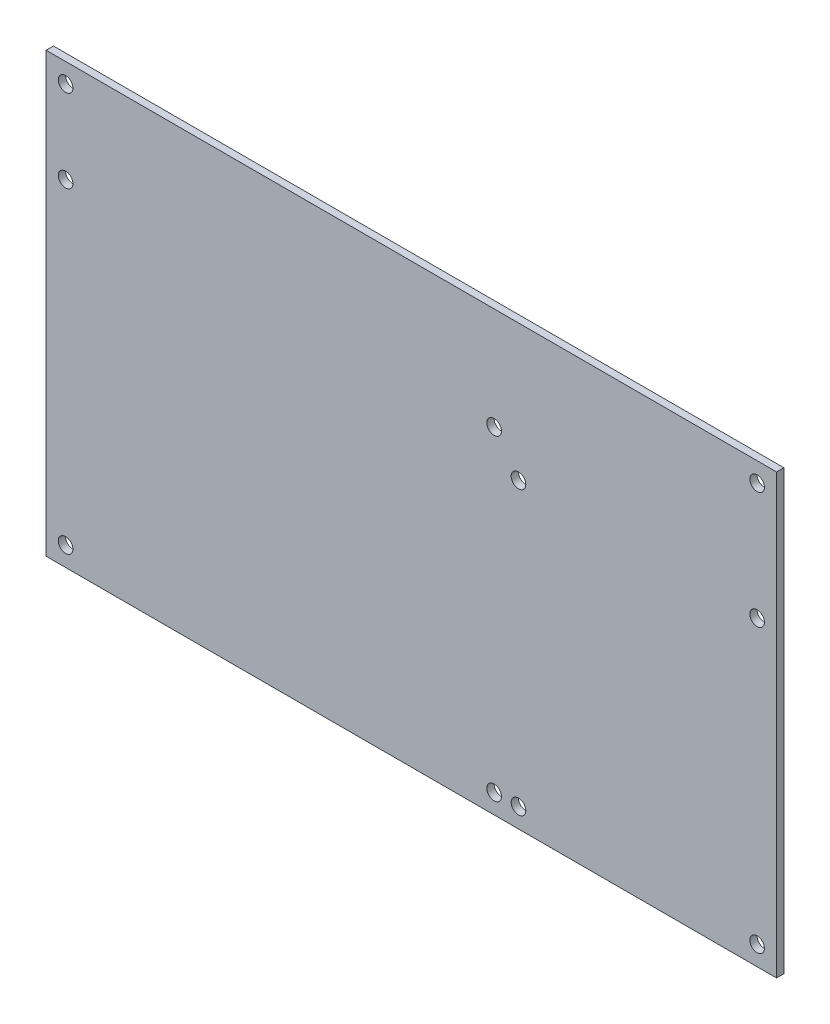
ISO-10303-21;
HEADER;
FILE_DESCRIPTION(('STEP AP214'),'2;1');
FILE_NAME('part.step','',(''),(''),'','','');
FILE_SCHEMA(('AUTOMOTIVE_DESIGN { 1 0 10303 214 1 1 1 1 }'));
ENDSEC;
DATA;
#1=APPLICATION_CONTEXT('core data for automotive mechanical design processes');
#2=APPLICATION_PROTOCOL_DEFINITION('international standard','automotive_design',2000,#1);
#3=PRODUCT_CONTEXT('',#1,'mechanical');
#4=PRODUCT('Part','Part','',(#3));
#5=PRODUCT_RELATED_PRODUCT_CATEGORY('part','',(#4));
#6=PRODUCT_DEFINITION_FORMATION('','',#4);
#7=PRODUCT_DEFINITION_CONTEXT('part definition',#1,'design');
#8=PRODUCT_DEFINITION('design','',#6,#7);
#9=PRODUCT_DEFINITION_SHAPE('','',#8);
#10=(LENGTH_UNIT() NAMED_UNIT(*) SI_UNIT(.MILLI.,.METRE.));
#11=(NAMED_UNIT(*) PLANE_ANGLE_UNIT() SI_UNIT($,.RADIAN.));
#12=(NAMED_UNIT(*) SI_UNIT($,.STERADIAN.) SOLID_ANGLE_UNIT());
#13=UNCERTAINTY_MEASURE_WITH_UNIT(LENGTH_MEASURE(1.E-05),#10,'distance_accuracy_value','');
#14=(GEOMETRIC_REPRESENTATION_CONTEXT(3) GLOBAL_UNCERTAINTY_ASSIGNED_CONTEXT((#13)) GLOBAL_UNIT_ASSIGNED_CONTEXT((#10,
#11,#12)) REPRESENTATION_CONTEXT('',''));
#15=CARTESIAN_POINT('',(0.,0.,0.));
#16=DIRECTION('',(0.,0.,1.));
#17=DIRECTION('',(1.,0.,0.));
#18=AXIS2_PLACEMENT_3D('',#15,#16,#17);
#19=CARTESIAN_POINT('',(0.,0.,1.5));
#20=DIRECTION('',(0.,0.,1.));
#21=DIRECTION('',(1.,0.,0.));
#22=AXIS2_PLACEMENT_3D('',#19,#20,#21);
#23=PLANE('',#22);
#24=CARTESIAN_POINT('',(97.,-86.,1.5));
#25=DIRECTION('',(0.,0.,1.));
#26=DIRECTION('',(1.,0.,0.));
#27=AXIS2_PLACEMENT_3D('',#24,#25,#26);
#28=CIRCLE('',#27,1.5);
#29=CARTESIAN_POINT('',(98.5,-86.,1.5));
#30=VERTEX_POINT('',#29);
#31=EDGE_CURVE('E203',#30,#30,#28,.T.);
#32=ORIENTED_EDGE('',*,*,#31,.F.);
#33=EDGE_LOOP('',(#32));
#34=FACE_BOUND('',#33,.T.);
#35=CARTESIAN_POINT('',(92.,-86.,1.5));
#36=DIRECTION('',(0.,0.,1.));
#37=DIRECTION('',(1.,0.,0.));
#38=AXIS2_PLACEMENT_3D('',#35,#36,#37);
#39=CIRCLE('',#38,1.5);
#40=CARTESIAN_POINT('',(93.5,-86.,1.5));
#41=VERTEX_POINT('',#40);
#42=EDGE_CURVE('E187',#41,#41,#39,.T.);
#43=ORIENTED_EDGE('',*,*,#42,.F.);
#44=EDGE_LOOP('',(#43));
#45=FACE_BOUND('',#44,.T.);
#46=CARTESIAN_POINT('',(97.,-28.,1.5));
#47=DIRECTION('',(0.,0.,1.));
#48=DIRECTION('',(1.,0.,0.));
#49=AXIS2_PLACEMENT_3D('',#46,#47,#48);
#50=CIRCLE('',#49,1.5);
#51=CARTESIAN_POINT('',(98.5,-28.,1.5));
#52=VERTEX_POINT('',#51);
#53=EDGE_CURVE('E171',#52,#52,#50,.T.);
#54=ORIENTED_EDGE('',*,*,#53,.F.);
#55=EDGE_LOOP('',(#54));
#56=FACE_BOUND('',#55,.T.);
#57=CARTESIAN_POINT('',(4.00000000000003,-86.,1.5));
#58=DIRECTION('',(0.,0.,1.));
#59=DIRECTION('',(-1.,0.,0.));
#60=AXIS2_PLACEMENT_3D('',#57,#58,#59);
#61=CIRCLE('',#60,1.5);
#62=CARTESIAN_POINT('',(2.50000000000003,-86.,1.5));
#63=VERTEX_POINT('',#62);
#64=EDGE_CURVE('E155',#63,#63,#61,.T.);
#65=ORIENTED_EDGE('',*,*,#64,.F.);
#66=EDGE_LOOP('',(#65));
#67=FACE_BOUND('',#66,.T.);
#68=CARTESIAN_POINT('',(146.,-4.,1.5));
#69=DIRECTION('',(0.,0.,1.));
#70=DIRECTION('',(1.,0.,0.));
#71=AXIS2_PLACEMENT_3D('',#68,#69,#70);
#72=CIRCLE('',#71,1.5);
#73=CARTESIAN_POINT('',(147.5,-4.,1.5));
#74=VERTEX_POINT('',#73);
#75=EDGE_CURVE('E123',#74,#74,#72,.T.);
#76=ORIENTED_EDGE('',*,*,#75,.F.);
#77=EDGE_LOOP('',(#76));
#78=FACE_BOUND('',#77,.T.);
#79=DIRECTION('',(0.,-1.,0.));
#80=VECTOR('',#79,1.);
#81=CARTESIAN_POINT('',(0.,0.,1.5));
#82=LINE('',#81,#80);
#83=CARTESIAN_POINT('',(0.,0.,1.5));
#84=VERTEX_POINT('',#83);
#85=CARTESIAN_POINT('',(0.,-90.,1.5));
#86=VERTEX_POINT('',#85);
#87=EDGE_CURVE('E102',#84,#86,#82,.T.);
#88=ORIENTED_EDGE('',*,*,#87,.T.);
#89=DIRECTION('',(1.,0.,0.));
#90=VECTOR('',#89,1.);
#91=CARTESIAN_POINT('',(0.,-90.,1.5));
#92=LINE('',#91,#90);
#93=CARTESIAN_POINT('',(150.,-90.,1.5));
#94=VERTEX_POINT('',#93);
#95=EDGE_CURVE('E97',#86,#94,#92,.T.);
#96=ORIENTED_EDGE('',*,*,#95,.T.);
#97=DIRECTION('',(0.,1.,0.));
#98=VECTOR('',#97,1.);
#99=CARTESIAN_POINT('',(150.,0.,1.5));
#100=LINE('',#99,#98);
#101=CARTESIAN_POINT('',(150.,0.,1.5));
#102=VERTEX_POINT('',#101);
#103=EDGE_CURVE('E100',#94,#102,#100,.T.);
#104=ORIENTED_EDGE('',*,*,#103,.T.);
#105=DIRECTION('',(-1.,0.,0.));
#106=VECTOR('',#105,1.);
#107=CARTESIAN_POINT('',(0.,0.,1.5));
#108=LINE('',#107,#106);
#109=EDGE_CURVE('E67',#102,#84,#108,.T.);
#110=ORIENTED_EDGE('',*,*,#109,.T.);
#111=EDGE_LOOP('',(#88,#96,#104,#110));
#112=FACE_BOUND('',#111,.T.);
#113=CARTESIAN_POINT('',(146.,-86.,1.5));
#114=DIRECTION('',(0.,0.,1.));
#115=DIRECTION('',(1.,0.,0.));
#116=AXIS2_PLACEMENT_3D('',#113,#114,#115);
#117=CIRCLE('',#116,1.5);
#118=CARTESIAN_POINT('',(147.5,-86.,1.5));
#119=VERTEX_POINT('',#118);
#120=EDGE_CURVE('E147',#119,#119,#117,.T.);
#121=ORIENTED_EDGE('',*,*,#120,.F.);
#122=EDGE_LOOP('',(#121));
#123=FACE_BOUND('',#122,.T.);
#124=CARTESIAN_POINT('',(4.,-4.00000000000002,1.5));
#125=DIRECTION('',(0.,0.,1.));
#126=DIRECTION('',(-1.,0.,0.));
#127=AXIS2_PLACEMENT_3D('',#124,#125,#126);
#128=CIRCLE('',#127,1.5);
#129=CARTESIAN_POINT('',(2.50000000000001,-4.00000000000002,1.5));
#130=VERTEX_POINT('',#129);
#131=EDGE_CURVE('E163',#130,#130,#128,.T.);
#132=ORIENTED_EDGE('',*,*,#131,.F.);
#133=EDGE_LOOP('',(#132));
#134=FACE_BOUND('',#133,.T.);
#135=CARTESIAN_POINT('',(4.00000000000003,-21.,1.5));
#136=DIRECTION('',(0.,0.,1.));
#137=DIRECTION('',(1.,0.,0.));
#138=AXIS2_PLACEMENT_3D('',#135,#136,#137);
#139=CIRCLE('',#138,1.5);
#140=CARTESIAN_POINT('',(5.50000000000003,-21.,1.5));
#141=VERTEX_POINT('',#140);
#142=EDGE_CURVE('E179',#141,#141,#139,.T.);
#143=ORIENTED_EDGE('',*,*,#142,.F.);
#144=EDGE_LOOP('',(#143));
#145=FACE_BOUND('',#144,.T.);
#146=CARTESIAN_POINT('',(92.,-20.9999999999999,1.5));
#147=DIRECTION('',(0.,0.,1.));
#148=DIRECTION('',(1.,0.,0.));
#149=AXIS2_PLACEMENT_3D('',#146,#147,#148);
#150=CIRCLE('',#149,1.5);
#151=CARTESIAN_POINT('',(93.5,-20.9999999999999,1.5));
#152=VERTEX_POINT('',#151);
#153=EDGE_CURVE('E195',#152,#152,#150,.T.);
#154=ORIENTED_EDGE('',*,*,#153,.F.);
#155=EDGE_LOOP('',(#154));
#156=FACE_BOUND('',#155,.T.);
#157=CARTESIAN_POINT('',(146.,-28.,1.5));
#158=DIRECTION('',(0.,0.,1.));
#159=DIRECTION('',(1.,0.,0.));
#160=AXIS2_PLACEMENT_3D('',#157,#158,#159);
#161=CIRCLE('',#160,1.5);
#162=CARTESIAN_POINT('',(147.5,-28.,1.5));
#163=VERTEX_POINT('',#162);
#164=EDGE_CURVE('E211',#163,#163,#161,.T.);
#165=ORIENTED_EDGE('',*,*,#164,.F.);
#166=EDGE_LOOP('',(#165));
#167=FACE_BOUND('',#166,.T.);
#168=ADVANCED_FACE('F49',(#34,#45,#56,#67,#78,#112,#123,#134,#145,#156,#167),#23,.T.);
#169=CARTESIAN_POINT('',(0.,0.,0.));
#170=DIRECTION('',(0.,0.,1.));
#171=DIRECTION('',(1.,0.,0.));
#172=AXIS2_PLACEMENT_3D('',#169,#170,#171);
#173=PLANE('',#172);
#174=DIRECTION('',(0.,-1.,0.));
#175=VECTOR('',#174,1.);
#176=CARTESIAN_POINT('',(0.,0.,0.));
#177=LINE('',#176,#175);
#178=CARTESIAN_POINT('',(0.,0.,0.));
#179=VERTEX_POINT('',#178);
#180=CARTESIAN_POINT('',(0.,-90.,0.));
#181=VERTEX_POINT('',#180);
#182=EDGE_CURVE('E119',#179,#181,#177,.T.);
#183=ORIENTED_EDGE('',*,*,#182,.F.);
#184=DIRECTION('',(-1.,0.,0.));
#185=VECTOR('',#184,1.);
#186=CARTESIAN_POINT('',(0.,0.,0.));
#187=LINE('',#186,#185);
#188=CARTESIAN_POINT('',(150.,0.,0.));
#189=VERTEX_POINT('',#188);
#190=EDGE_CURVE('E90',#189,#179,#187,.T.);
#191=ORIENTED_EDGE('',*,*,#190,.F.);
#192=DIRECTION('',(0.,1.,0.));
#193=VECTOR('',#192,1.);
#194=CARTESIAN_POINT('',(150.,0.,0.));
#195=LINE('',#194,#193);
#196=CARTESIAN_POINT('',(150.,-90.,0.));
#197=VERTEX_POINT('',#196);
#198=EDGE_CURVE('E84',#197,#189,#195,.T.);
#199=ORIENTED_EDGE('',*,*,#198,.F.);
#200=DIRECTION('',(1.,0.,0.));
#201=VECTOR('',#200,1.);
#202=CARTESIAN_POINT('',(0.,-90.,0.));
#203=LINE('',#202,#201);
#204=EDGE_CURVE('E107',#181,#197,#203,.T.);
#205=ORIENTED_EDGE('',*,*,#204,.F.);
#206=EDGE_LOOP('',(#183,#191,#199,#205));
#207=FACE_BOUND('',#206,.T.);
#208=CARTESIAN_POINT('',(146.,-4.,0.));
#209=DIRECTION('',(0.,0.,1.));
#210=DIRECTION('',(1.,0.,0.));
#211=AXIS2_PLACEMENT_3D('',#208,#209,#210);
#212=CIRCLE('',#211,1.5);
#213=CARTESIAN_POINT('',(147.5,-4.,0.));
#214=VERTEX_POINT('',#213);
#215=EDGE_CURVE('E143',#214,#214,#212,.T.);
#216=ORIENTED_EDGE('',*,*,#215,.T.);
#217=EDGE_LOOP('',(#216));
#218=FACE_BOUND('',#217,.T.);
#219=CARTESIAN_POINT('',(146.,-86.,0.));
#220=DIRECTION('',(0.,0.,1.));
#221=DIRECTION('',(1.,0.,0.));
#222=AXIS2_PLACEMENT_3D('',#219,#220,#221);
#223=CIRCLE('',#222,1.5);
#224=CARTESIAN_POINT('',(147.5,-86.,0.));
#225=VERTEX_POINT('',#224);
#226=EDGE_CURVE('E151',#225,#225,#223,.T.);
#227=ORIENTED_EDGE('',*,*,#226,.T.);
#228=EDGE_LOOP('',(#227));
#229=FACE_BOUND('',#228,.T.);
#230=CARTESIAN_POINT('',(4.00000000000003,-86.,0.));
#231=DIRECTION('',(0.,0.,1.));
#232=DIRECTION('',(-1.,0.,0.));
#233=AXIS2_PLACEMENT_3D('',#230,#231,#232);
#234=CIRCLE('',#233,1.5);
#235=CARTESIAN_POINT('',(2.50000000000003,-86.,0.));
#236=VERTEX_POINT('',#235);
#237=EDGE_CURVE('E159',#236,#236,#234,.T.);
#238=ORIENTED_EDGE('',*,*,#237,.T.);
#239=EDGE_LOOP('',(#238));
#240=FACE_BOUND('',#239,.T.);
#241=CARTESIAN_POINT('',(4.,-4.00000000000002,0.));
#242=DIRECTION('',(0.,0.,1.));
#243=DIRECTION('',(-1.,0.,0.));
#244=AXIS2_PLACEMENT_3D('',#241,#242,#243);
#245=CIRCLE('',#244,1.5);
#246=CARTESIAN_POINT('',(2.50000000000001,-4.00000000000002,0.));
#247=VERTEX_POINT('',#246);
#248=EDGE_CURVE('E167',#247,#247,#245,.T.);
#249=ORIENTED_EDGE('',*,*,#248,.T.);
#250=EDGE_LOOP('',(#249));
#251=FACE_BOUND('',#250,.T.);
#252=CARTESIAN_POINT('',(97.,-28.,0.));
#253=DIRECTION('',(0.,0.,1.));
#254=DIRECTION('',(1.,0.,0.));
#255=AXIS2_PLACEMENT_3D('',#252,#253,#254);
#256=CIRCLE('',#255,1.5);
#257=CARTESIAN_POINT('',(98.5,-28.,0.));
#258=VERTEX_POINT('',#257);
#259=EDGE_CURVE('E175',#258,#258,#256,.T.);
#260=ORIENTED_EDGE('',*,*,#259,.T.);
#261=EDGE_LOOP('',(#260));
#262=FACE_BOUND('',#261,.T.);
#263=CARTESIAN_POINT('',(4.00000000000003,-21.,0.));
#264=DIRECTION('',(0.,0.,1.));
#265=DIRECTION('',(1.,0.,0.));
#266=AXIS2_PLACEMENT_3D('',#263,#264,#265);
#267=CIRCLE('',#266,1.5);
#268=CARTESIAN_POINT('',(5.50000000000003,-21.,0.));
#269=VERTEX_POINT('',#268);
#270=EDGE_CURVE('E183',#269,#269,#267,.T.);
#271=ORIENTED_EDGE('',*,*,#270,.T.);
#272=EDGE_LOOP('',(#271));
#273=FACE_BOUND('',#272,.T.);
#274=CARTESIAN_POINT('',(92.,-86.,0.));
#275=DIRECTION('',(0.,0.,1.));
#276=DIRECTION('',(1.,0.,0.));
#277=AXIS2_PLACEMENT_3D('',#274,#275,#276);
#278=CIRCLE('',#277,1.5);
#279=CARTESIAN_POINT('',(93.5,-86.,0.));
#280=VERTEX_POINT('',#279);
#281=EDGE_CURVE('E191',#280,#280,#278,.T.);
#282=ORIENTED_EDGE('',*,*,#281,.T.);
#283=EDGE_LOOP('',(#282));
#284=FACE_BOUND('',#283,.T.);
#285=CARTESIAN_POINT('',(92.,-20.9999999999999,0.));
#286=DIRECTION('',(0.,0.,1.));
#287=DIRECTION('',(1.,0.,0.));
#288=AXIS2_PLACEMENT_3D('',#285,#286,#287);
#289=CIRCLE('',#288,1.5);
#290=CARTESIAN_POINT('',(93.5,-20.9999999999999,0.));
#291=VERTEX_POINT('',#290);
#292=EDGE_CURVE('E199',#291,#291,#289,.T.);
#293=ORIENTED_EDGE('',*,*,#292,.T.);
#294=EDGE_LOOP('',(#293));
#295=FACE_BOUND('',#294,.T.);
#296=CARTESIAN_POINT('',(97.,-86.,0.));
#297=DIRECTION('',(0.,0.,1.));
#298=DIRECTION('',(1.,0.,0.));
#299=AXIS2_PLACEMENT_3D('',#296,#297,#298);
#300=CIRCLE('',#299,1.5);
#301=CARTESIAN_POINT('',(98.5,-86.,0.));
#302=VERTEX_POINT('',#301);
#303=EDGE_CURVE('E207',#302,#302,#300,.T.);
#304=ORIENTED_EDGE('',*,*,#303,.T.);
#305=EDGE_LOOP('',(#304));
#306=FACE_BOUND('',#305,.T.);
#307=CARTESIAN_POINT('',(146.,-28.,0.));
#308=DIRECTION('',(0.,0.,1.));
#309=DIRECTION('',(1.,0.,0.));
#310=AXIS2_PLACEMENT_3D('',#307,#308,#309);
#311=CIRCLE('',#310,1.5);
#312=CARTESIAN_POINT('',(147.5,-28.,0.));
#313=VERTEX_POINT('',#312);
#314=EDGE_CURVE('E215',#313,#313,#311,.T.);
#315=ORIENTED_EDGE('',*,*,#314,.T.);
#316=EDGE_LOOP('',(#315));
#317=FACE_BOUND('',#316,.T.);
#318=ADVANCED_FACE('F137',(#207,#218,#229,#240,#251,#262,#273,#284,#295,#306,#317),#173,.F.);
#319=CARTESIAN_POINT('',(0.,0.,1.5));
#320=DIRECTION('',(1.,0.,0.));
#321=DIRECTION('',(0.,1.,0.));
#322=AXIS2_PLACEMENT_3D('',#319,#320,#321);
#323=PLANE('',#322);
#324=ORIENTED_EDGE('',*,*,#182,.T.);
#325=DIRECTION('',(0.,0.,-1.));
#326=VECTOR('',#325,1.);
#327=CARTESIAN_POINT('',(0.,-90.,1.5));
#328=LINE('',#327,#326);
#329=EDGE_CURVE('E11',#86,#181,#328,.T.);
#330=ORIENTED_EDGE('',*,*,#329,.F.);
#331=ORIENTED_EDGE('',*,*,#87,.F.);
#332=DIRECTION('',(0.,0.,-1.));
#333=VECTOR('',#332,1.);
#334=CARTESIAN_POINT('',(0.,0.,1.5));
#335=LINE('',#334,#333);
#336=EDGE_CURVE('E115',#84,#179,#335,.T.);
#337=ORIENTED_EDGE('',*,*,#336,.T.);
#338=EDGE_LOOP('',(#324,#330,#331,#337));
#339=FACE_BOUND('',#338,.T.);
#340=ADVANCED_FACE('F51',(#339),#323,.F.);
#341=CARTESIAN_POINT('',(0.,-90.,1.5));
#342=DIRECTION('',(0.,1.,0.));
#343=DIRECTION('',(0.,0.,1.));
#344=AXIS2_PLACEMENT_3D('',#341,#342,#343);
#345=PLANE('',#344);
#346=ORIENTED_EDGE('',*,*,#204,.T.);
#347=DIRECTION('',(0.,0.,-1.));
#348=VECTOR('',#347,1.);
#349=CARTESIAN_POINT('',(150.,-90.,1.5));
#350=LINE('',#349,#348);
#351=EDGE_CURVE('E59',#94,#197,#350,.T.);
#352=ORIENTED_EDGE('',*,*,#351,.F.);
#353=ORIENTED_EDGE('',*,*,#95,.F.);
#354=ORIENTED_EDGE('',*,*,#329,.T.);
#355=EDGE_LOOP('',(#346,#352,#353,#354));
#356=FACE_BOUND('',#355,.T.);
#357=ADVANCED_FACE('F106',(#356),#345,.F.);
#358=CARTESIAN_POINT('',(150.,0.,1.5));
#359=DIRECTION('',(-1.,0.,0.));
#360=DIRECTION('',(0.,0.,1.));
#361=AXIS2_PLACEMENT_3D('',#358,#359,#360);
#362=PLANE('',#361);
#363=ORIENTED_EDGE('',*,*,#198,.T.);
#364=DIRECTION('',(0.,0.,-1.));
#365=VECTOR('',#364,1.);
#366=CARTESIAN_POINT('',(150.,0.,1.5));
#367=LINE('',#366,#365);
#368=EDGE_CURVE('E109',#102,#189,#367,.T.);
#369=ORIENTED_EDGE('',*,*,#368,.F.);
#370=ORIENTED_EDGE('',*,*,#103,.F.);
#371=ORIENTED_EDGE('',*,*,#351,.T.);
#372=EDGE_LOOP('',(#363,#369,#370,#371));
#373=FACE_BOUND('',#372,.T.);
#374=ADVANCED_FACE('F110',(#373),#362,.F.);
#375=CARTESIAN_POINT('',(0.,0.,1.5));
#376=DIRECTION('',(0.,-1.,0.));
#377=DIRECTION('',(0.,0.,-1.));
#378=AXIS2_PLACEMENT_3D('',#375,#376,#377);
#379=PLANE('',#378);
#380=ORIENTED_EDGE('',*,*,#190,.T.);
#381=ORIENTED_EDGE('',*,*,#336,.F.);
#382=ORIENTED_EDGE('',*,*,#109,.F.);
#383=ORIENTED_EDGE('',*,*,#368,.T.);
#384=EDGE_LOOP('',(#380,#381,#382,#383));
#385=FACE_BOUND('',#384,.T.);
#386=ADVANCED_FACE('F134',(#385),#379,.F.);
#387=CARTESIAN_POINT('',(146.,-4.,1.5));
#388=DIRECTION('',(0.,0.,-1.));
#389=DIRECTION('',(-1.,0.,0.));
#390=AXIS2_PLACEMENT_3D('',#387,#388,#389);
#391=CYLINDRICAL_SURFACE('',#390,1.5);
#392=ORIENTED_EDGE('',*,*,#75,.T.);
#393=EDGE_LOOP('',(#392));
#394=FACE_BOUND('',#393,.T.);
#395=ORIENTED_EDGE('',*,*,#215,.F.);
#396=EDGE_LOOP('',(#395));
#397=FACE_BOUND('',#396,.T.);
#398=ADVANCED_FACE('F237',(#394,#397),#391,.F.);
#399=CARTESIAN_POINT('',(146.,-86.,1.5));
#400=DIRECTION('',(0.,0.,-1.));
#401=DIRECTION('',(-1.,0.,0.));
#402=AXIS2_PLACEMENT_3D('',#399,#400,#401);
#403=CYLINDRICAL_SURFACE('',#402,1.5);
#404=ORIENTED_EDGE('',*,*,#120,.T.);
#405=EDGE_LOOP('',(#404));
#406=FACE_BOUND('',#405,.T.);
#407=ORIENTED_EDGE('',*,*,#226,.F.);
#408=EDGE_LOOP('',(#407));
#409=FACE_BOUND('',#408,.T.);
#410=ADVANCED_FACE('F288',(#406,#409),#403,.F.);
#411=CARTESIAN_POINT('',(4.00000000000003,-86.,1.5));
#412=DIRECTION('',(0.,0.,-1.));
#413=DIRECTION('',(-1.,0.,0.));
#414=AXIS2_PLACEMENT_3D('',#411,#412,#413);
#415=CYLINDRICAL_SURFACE('',#414,1.5);
#416=ORIENTED_EDGE('',*,*,#64,.T.);
#417=EDGE_LOOP('',(#416));
#418=FACE_BOUND('',#417,.T.);
#419=ORIENTED_EDGE('',*,*,#237,.F.);
#420=EDGE_LOOP('',(#419));
#421=FACE_BOUND('',#420,.T.);
#422=ADVANCED_FACE('F296',(#418,#421),#415,.F.);
#423=CARTESIAN_POINT('',(4.,-4.00000000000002,1.5));
#424=DIRECTION('',(0.,0.,-1.));
#425=DIRECTION('',(-1.,0.,0.));
#426=AXIS2_PLACEMENT_3D('',#423,#424,#425);
#427=CYLINDRICAL_SURFACE('',#426,1.5);
#428=ORIENTED_EDGE('',*,*,#131,.T.);
#429=EDGE_LOOP('',(#428));
#430=FACE_BOUND('',#429,.T.);
#431=ORIENTED_EDGE('',*,*,#248,.F.);
#432=EDGE_LOOP('',(#431));
#433=FACE_BOUND('',#432,.T.);
#434=ADVANCED_FACE('F304',(#430,#433),#427,.F.);
#435=CARTESIAN_POINT('',(97.,-28.,1.5));
#436=DIRECTION('',(0.,0.,-1.));
#437=DIRECTION('',(-1.,0.,0.));
#438=AXIS2_PLACEMENT_3D('',#435,#436,#437);
#439=CYLINDRICAL_SURFACE('',#438,1.5);
#440=ORIENTED_EDGE('',*,*,#53,.T.);
#441=EDGE_LOOP('',(#440));
#442=FACE_BOUND('',#441,.T.);
#443=ORIENTED_EDGE('',*,*,#259,.F.);
#444=EDGE_LOOP('',(#443));
#445=FACE_BOUND('',#444,.T.);
#446=ADVANCED_FACE('F313',(#442,#445),#439,.F.);
#447=CARTESIAN_POINT('',(4.00000000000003,-21.,1.5));
#448=DIRECTION('',(0.,0.,-1.));
#449=DIRECTION('',(-1.,0.,0.));
#450=AXIS2_PLACEMENT_3D('',#447,#448,#449);
#451=CYLINDRICAL_SURFACE('',#450,1.5);
#452=ORIENTED_EDGE('',*,*,#142,.T.);
#453=EDGE_LOOP('',(#452));
#454=FACE_BOUND('',#453,.T.);
#455=ORIENTED_EDGE('',*,*,#270,.F.);
#456=EDGE_LOOP('',(#455));
#457=FACE_BOUND('',#456,.T.);
#458=ADVANCED_FACE('F322',(#454,#457),#451,.F.);
#459=CARTESIAN_POINT('',(92.,-86.,1.5));
#460=DIRECTION('',(0.,0.,-1.));
#461=DIRECTION('',(-1.,0.,0.));
#462=AXIS2_PLACEMENT_3D('',#459,#460,#461);
#463=CYLINDRICAL_SURFACE('',#462,1.5);
#464=ORIENTED_EDGE('',*,*,#42,.T.);
#465=EDGE_LOOP('',(#464));
#466=FACE_BOUND('',#465,.T.);
#467=ORIENTED_EDGE('',*,*,#281,.F.);
#468=EDGE_LOOP('',(#467));
#469=FACE_BOUND('',#468,.T.);
#470=ADVANCED_FACE('F331',(#466,#469),#463,.F.);
#471=CARTESIAN_POINT('',(92.,-20.9999999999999,1.5));
#472=DIRECTION('',(0.,0.,-1.));
#473=DIRECTION('',(-1.,0.,0.));
#474=AXIS2_PLACEMENT_3D('',#471,#472,#473);
#475=CYLINDRICAL_SURFACE('',#474,1.5);
#476=ORIENTED_EDGE('',*,*,#153,.T.);
#477=EDGE_LOOP('',(#476));
#478=FACE_BOUND('',#477,.T.);
#479=ORIENTED_EDGE('',*,*,#292,.F.);
#480=EDGE_LOOP('',(#479));
#481=FACE_BOUND('',#480,.T.);
#482=ADVANCED_FACE('F340',(#478,#481),#475,.F.);
#483=CARTESIAN_POINT('',(97.,-86.,1.5));
#484=DIRECTION('',(0.,0.,-1.));
#485=DIRECTION('',(-1.,0.,0.));
#486=AXIS2_PLACEMENT_3D('',#483,#484,#485);
#487=CYLINDRICAL_SURFACE('',#486,1.5);
#488=ORIENTED_EDGE('',*,*,#31,.T.);
#489=EDGE_LOOP('',(#488));
#490=FACE_BOUND('',#489,.T.);
#491=ORIENTED_EDGE('',*,*,#303,.F.);
#492=EDGE_LOOP('',(#491));
#493=FACE_BOUND('',#492,.T.);
#494=ADVANCED_FACE('F349',(#490,#493),#487,.F.);
#495=CARTESIAN_POINT('',(146.,-28.,1.5));
#496=DIRECTION('',(0.,0.,-1.));
#497=DIRECTION('',(-1.,0.,0.));
#498=AXIS2_PLACEMENT_3D('',#495,#496,#497);
#499=CYLINDRICAL_SURFACE('',#498,1.5);
#500=ORIENTED_EDGE('',*,*,#164,.T.);
#501=EDGE_LOOP('',(#500));
#502=FACE_BOUND('',#501,.T.);
#503=ORIENTED_EDGE('',*,*,#314,.F.);
#504=EDGE_LOOP('',(#503));
#505=FACE_BOUND('',#504,.T.);
#506=ADVANCED_FACE('F224',(#502,#505),#499,.F.);
#507=CLOSED_SHELL('',(#168,#318,#340,#357,#374,#386,#398,#410,#422,#434,#446,#458,#470,#482,
#494,#506));
#508=MANIFOLD_SOLID_BREP('B2',#507);
#509=ADVANCED_BREP_SHAPE_REPRESENTATION('',(#18,#508),#14);
#510=SHAPE_DEFINITION_REPRESENTATION(#9,#509);
ENDSEC;
END-ISO-10303-21;
